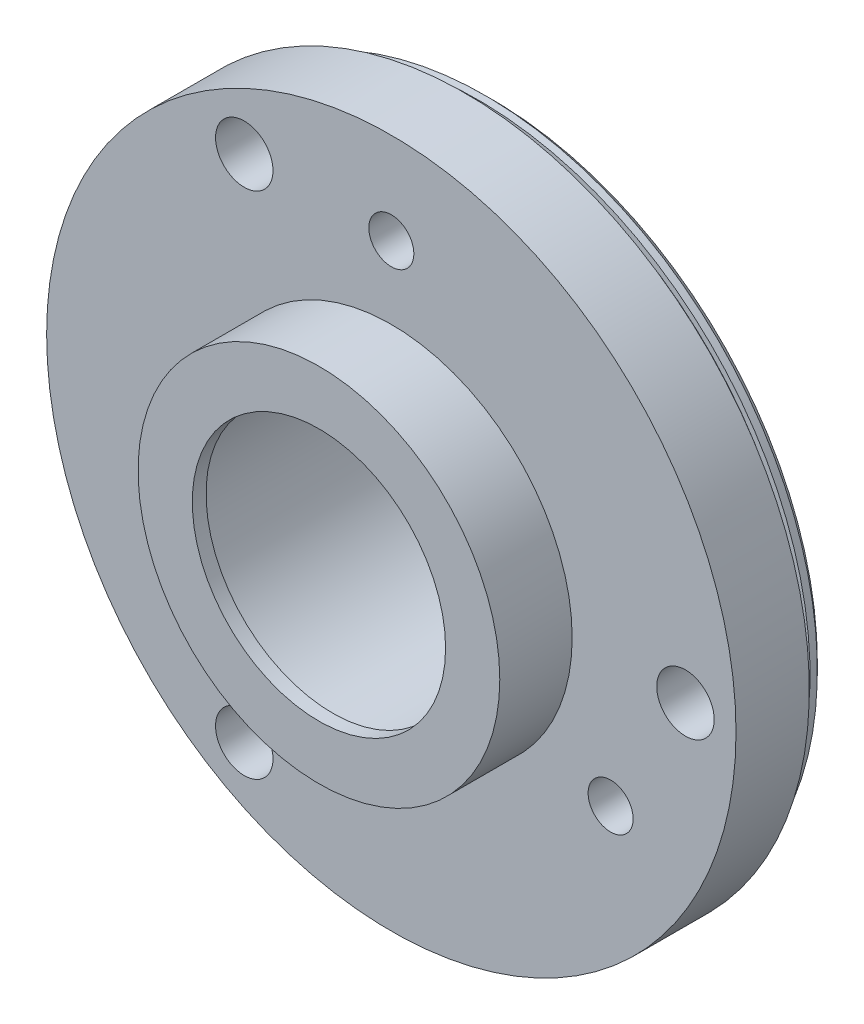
from build123d import *

# Parameters (mm, degrees)
SKETCH2_R           = 19.05
BASE_EXTRUDE_DEPTH  = 10.5918
SKETCH5_R           = 22.86
SKETCH5_R_2         = 9.9949
CUT_EXTRUDE3_DEPTH  = 4.0005
SKETCH7_R           = 20.32
SKETCH7_R_2         = 12.3444
CUT_EXTRUDE4_DEPTH  = 1.016
SKETCH10_R          = 1.0922
CUT_EXTRUDE7_DEPTH  = 28.735360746
SKETCH11_R          = 1.5875
CUT_EXTRUDE8_DEPTH  = 3.0353
SKETCH12_R          = 0.3937
CUT_EXTRUDE9_DEPTH  = 1.778
SKETCH14_R          = 20.32
SKETCH14_R_2        = 18.3515
CUT_EXTRUDE11_DEPTH = 1.524
SKETCH15_W          = 0.7366
SKETCH15_H          = 1.27
SKETCH16_R          = 1.2446
CUT_EXTRUDE12_DEPTH = 4.572
CHAMFER2_SIZE       = 0.381
SKETCH18_R          = 8.255
BOSS_EXTRUDE1_DEPTH = 0.635
SKETCH19_R          = 7.94512
CUT_EXTRUDE13_DEPTH = 10.4648
SKETCH20_R          = 6.999986
CUT_EXTRUDE14_DEPTH = 30.186401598
CHAMFER4_SIZE       = 0.381
CHAMFER4_SIZE2      = 0.177663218


with BuildPart() as part:
    # Sketch2 → Base-Extrude (new body)
    with BuildSketch(Plane.XY):
        Circle(SKETCH2_R)
    extrude(amount=BASE_EXTRUDE_DEPTH)

    # Sketch5 → Cut-Extrude3 (cut)
    with BuildSketch(Plane.XY.offset(10.5918)):
        Circle(SKETCH5_R)
        Circle(SKETCH5_R_2, mode=Mode.SUBTRACT)
    extrude(amount=-CUT_EXTRUDE3_DEPTH, mode=Mode.SUBTRACT)

    # Sketch7 → Cut-Extrude4 (cut)
    with BuildSketch(Plane(origin=(0, 0, 0), x_dir=(-1, 0, 0), z_dir=(0, 0, -1))):
        Circle(SKETCH7_R)
        Circle(SKETCH7_R_2, mode=Mode.SUBTRACT)
    extrude(amount=-CUT_EXTRUDE4_DEPTH, mode=Mode.SUBTRACT)

    # Sketch10 → Cut-Extrude7 (cut, through all)
    with BuildSketch(Plane.XY.offset(6.5913)):
        with Locations((-8.128, 14.078108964)):
            Circle(SKETCH10_R)
        with Locations((-8.128, -14.078108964)):
            Circle(SKETCH10_R)
        with Locations((16.256, 0)):
            Circle(SKETCH10_R)
    extrude(amount=-CUT_EXTRUDE7_DEPTH, mode=Mode.SUBTRACT)

    # Sketch11 → Cut-Extrude8 (cut)
    with BuildSketch(Plane.XY.offset(6.5913)):
        with Locations((-8.128, 14.078108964)):
            Circle(SKETCH11_R)
        with Locations((16.256, 0)):
            Circle(SKETCH11_R)
        with Locations((-8.128, -14.078108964)):
            Circle(SKETCH11_R)
    extrude(amount=-CUT_EXTRUDE8_DEPTH, mode=Mode.SUBTRACT)

    # Sketch12 → Cut-Extrude9 (cut)
    with BuildSketch(Plane(origin=(0, 0, 1.016), x_dir=(-1, 0, 0), z_dir=(0, 0, -1))):
        with Locations((10.509194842, 13.946172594)):
            Circle(SKETCH12_R)
    extrude(amount=-CUT_EXTRUDE9_DEPTH, mode=Mode.SUBTRACT)

    # Sketch14 → Cut-Extrude11 (cut)
    with BuildSketch(Plane(origin=(0, 0, 1.016), x_dir=(-1, 0, 0), z_dir=(0, 0, -1))):
        Circle(SKETCH14_R)
        Circle(SKETCH14_R_2, mode=Mode.SUBTRACT)
    extrude(amount=-CUT_EXTRUDE11_DEPTH, mode=Mode.SUBTRACT)

    # Sketch15 → Cut-Revolve1 (revolve, cut)
    with BuildSketch(Plane(origin=(0, 0, 0), x_dir=(0, 0, -1), z_dir=(1, 0, 0)), mode=Mode.PRIVATE) as cut_revolve1_sk:
        with Locations((-2.1717, 18.669)):
            Rectangle(SKETCH15_W, SKETCH15_H)
    revolve(cut_revolve1_sk.sketch.rotate(Axis((0, 0, 0), (0, 0, 1)), 90), axis=Axis((0, 0, 0), (0, 0, 1)), mode=Mode.SUBTRACT)

    # Sketch16 → Cut-Extrude12 (cut)
    with BuildSketch(Plane.XY.offset(6.5913)):
        with Locations((0, 13.9954)):
            Circle(SKETCH16_R)
        with Locations((12.120371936, -6.9977)):
            Circle(SKETCH16_R)
        with Locations((-12.120371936, -6.9977)):
            Circle(SKETCH16_R)
    extrude(amount=-CUT_EXTRUDE12_DEPTH, mode=Mode.SUBTRACT)

    # Chamfer2
    chamfer2_edges = [part.edges().sort_by_distance(p)[0] for p in [
        (18.3515, 0, 1.016),
    ]]
    chamfer(chamfer2_edges, length=CHAMFER2_SIZE)

    # Sketch18 → Boss-Extrude1 (add)
    with BuildSketch(Plane(origin=(0, 0, 0), x_dir=(-1, 0, 0), z_dir=(0, 0, -1))):
        with Locations(Location((0, 0, 0), (0, 0, 180))):
            Circle(SKETCH18_R)
    extrude(amount=BOSS_EXTRUDE1_DEPTH)

    # Sketch19 → Cut-Extrude13 (cut)
    with BuildSketch(Plane(origin=(0, 0, -0.635), x_dir=(-1, 0, 0), z_dir=(0, 0, -1))):
        Circle(SKETCH19_R)
    extrude(amount=-CUT_EXTRUDE13_DEPTH, mode=Mode.SUBTRACT)

    # Sketch20 → Cut-Extrude14 (cut, through all)
    with BuildSketch(Plane.XY.offset(10.5918)):
        Circle(SKETCH20_R)
    extrude(amount=-CUT_EXTRUDE14_DEPTH, mode=Mode.SUBTRACT)

    # Chamfer4
    chamfer4_edges = [part.edges().sort_by_distance(p)[0] for p in [
        (-8.255, 0, -0.635),
    ]]
    chamfer4_side = [part.faces().sort_by_distance(p)[0] for p in [
        (-8.255, 0, -0.3175),
    ]]
    chamfer(chamfer4_edges, length=CHAMFER4_SIZE, length2=CHAMFER4_SIZE2, reference=chamfer4_side[0])


solid = part.part
